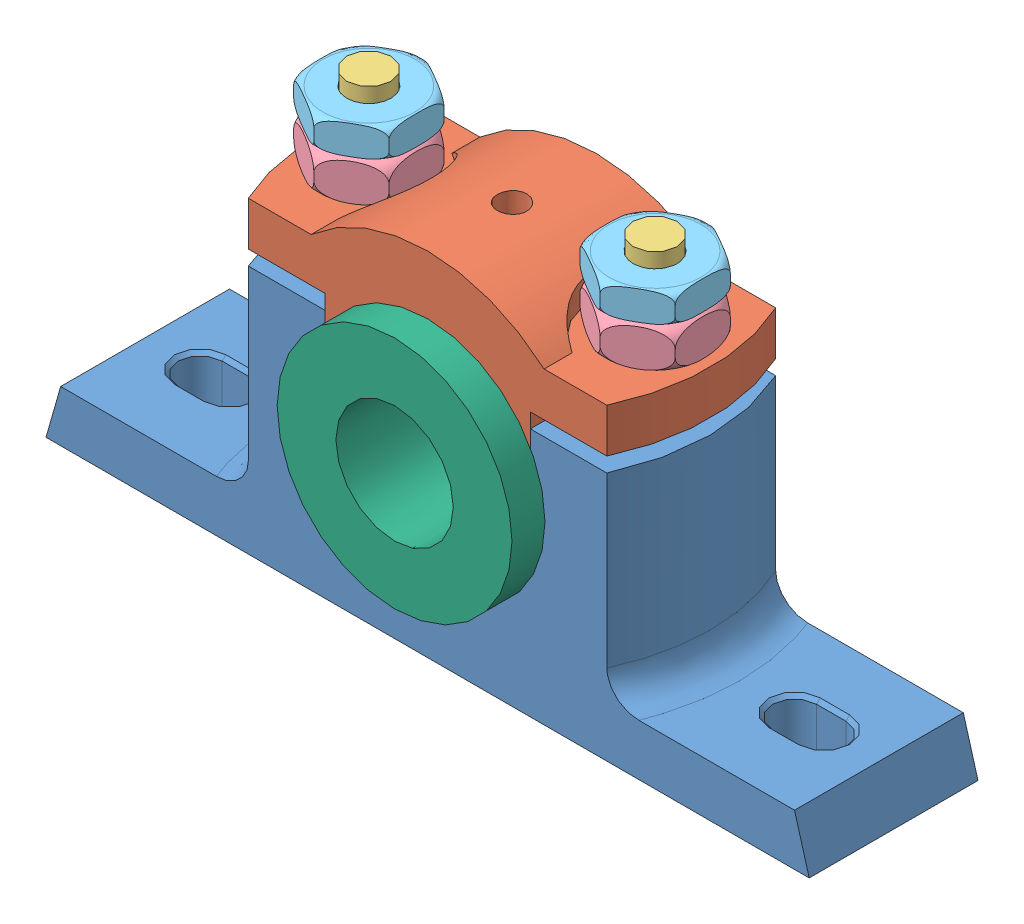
SolidWorks assembly plummer block.SLDASM, configuration Default (file format 7000). Lengths in mm.
Overall size (208 606.38 64).
9 component instances, 6 part files, 23 mates.
Components (placement in the parent):
- casting-1: casting.SLDPRT [Default] at origin size (208 68 46)
- cap-1: cap.SLDPRT [Default] at (0 48 0) size (108 40 46)
- bolt-1: bolt.SLDPRT [Default] at (-39 12 0) x (0 0 1) z (-1 0 0) size (26.18 105 26.18)
- nut-1: nut.SLDPRT [Default] at (39 84 0) x (0.866025 0 -0.5) z (0.5 0 0.866025) size (31.62 12 27.6)
- lock nut-1: lock nut.SLDPRT [Default] at (-39 100 0) x (0.866025 0 0.5) z (-0.5 0 0.866025) size (31.3 9.54 27.28)
- brasses-1: brasses.SLDPRT [Default] at (0 48 0) x (0 0 -1) z (1 0 0) size (64 64 64)
- bolt-3: bolt.SLDPRT [Default] at (39 12 0) x (-1 0 0) z (0 0 -1) size (26.18 105 26.18)
- nut-2: nut.SLDPRT [Default] at (-39 84 0) x (0.866025 0 0.5) z (-0.5 0 0.866025) size (31.62 12 27.6)
- lock nut-2: lock nut.SLDPRT [Default] at (39 100 0) x (0 0 -1) z (1 0 0) size (31.3 9.54 27.28)
Mates (geometry in assembly coordinates):
- Concentric1: concentric anti-aligned: cylinder of ? through (39 68 0) axis (0 -1 0) radius 6; cylinder of ? through (39 56 0) axis (0 1 0) radius 6
- Concentric3: concentric anti-aligned: cylinder of ? through (0 48 23) axis (0 0 -1) radius 24; cylinder of ? through (0 48 34.2237) axis (0 0 1) radius 22
- Concentric4: concentric aligned: cylinder of ? through (0 0 0) axis (0 -1 0) radius 4; cylinder of ? through (0 500048 0) axis (0 -1 0) radius 4
- Concentric5: concentric anti-aligned: cylinder of ? through (-39 68 0) axis (0 -1 0) radius 6; cylinder of ? through (-39 56 0) axis (0 1 0) radius 6
- Concentric7: concentric anti-aligned: cylinder of ? through (0 48 23) axis (0 0 -1) radius 24; cylinder of ? through (0 48 34.2237) axis (0 0 1) radius 24
- Concentric8: concentric anti-aligned: cylinder of ? through (-39 56 0) axis (0 1 0) radius 6; cylinder of ? through (-39 108 0) axis (0 -1 0) radius 6
- Coincident9: coincident anti-aligned: plane of casting-1 through (-26 12 -13) normal (0 -1 0); plane of bolt-1 through (-51 12 -12) normal (0 1 0)
- Concentric10: concentric anti-aligned: cylinder of ? through (39 56 0) axis (0 1 0) radius 6; cylinder of ? through (39 108 0) axis (0 -1 0) radius 6
- Parallel1: parallel anti-aligned: plane of casting-1 through (26 12 13) normal (1 0 0); plane of bolt-3 through (27 4 12) normal (-1 0 0)
- Coincident10: coincident anti-aligned: plane of casting-1 through (26 12 -13) normal (0 -1 0)
- Parallel3: parallel anti-aligned: plane of casting-1 through (-52 12 13) normal (1 0 0); plane of bolt-1 through (-51 4 -12) normal (-1 0 0)
- Concentric11: concentric aligned: cylinder of ? through (39 96 0) axis (0 -1 0) radius 6; cylinder of ? through (39 108 0) axis (0 -1 0) radius 6
- Coincident11: coincident anti-aligned: plane of cap-1 through (54 84 23) normal (0 1 0); plane of nut-1 through (51.9904 84 -22.5) normal (0 -1 0)
- Concentric12: concentric aligned: cylinder of ? through (39 108 0) axis (0 -1 0) radius 6; cylinder of ? through (39 104 0) axis (0 -1 0) radius 6
- Coincident12: coincident anti-aligned: plane of nut-1 through (51.9904 96 -22.5) normal (0 1 0); plane of lock nut-2 through (26.0096 96 -22.5) normal (0 -1 0)
- Parallel4: parallel aligned: plane of nut-1 through (51.9904 96 7.5) normal (1 0 0)
- Parallel5: parallel aligned: plane of lock nut-2 through (51.9904 104 7.5) normal (1 0 0)
- Concentric13: concentric aligned: cylinder of ? through (-39 108 0) axis (0 -1 0) radius 6; cylinder of ? through (-39 96 0) axis (0 -1 0) radius 6
- Coincident14: coincident anti-aligned: plane of cap-1 through (-54 84 23) normal (0 1 0)
- Concentric14: concentric aligned: cylinder of ? through (-39 108 0) axis (0 -1 0) radius 6; cylinder of ? through (-39 104 0) axis (0 -1 0) radius 6
- Coincident15: coincident anti-aligned: plane of ?; plane of ?
- Parallel6: parallel anti-aligned: plane of nut-2 through (-51.9904 96 -7.5) normal (-1 0 0)
- Parallel7: parallel anti-aligned: plane of lock nut-1 through (-51.9904 104 -7.5) normal (-1 0 0)
